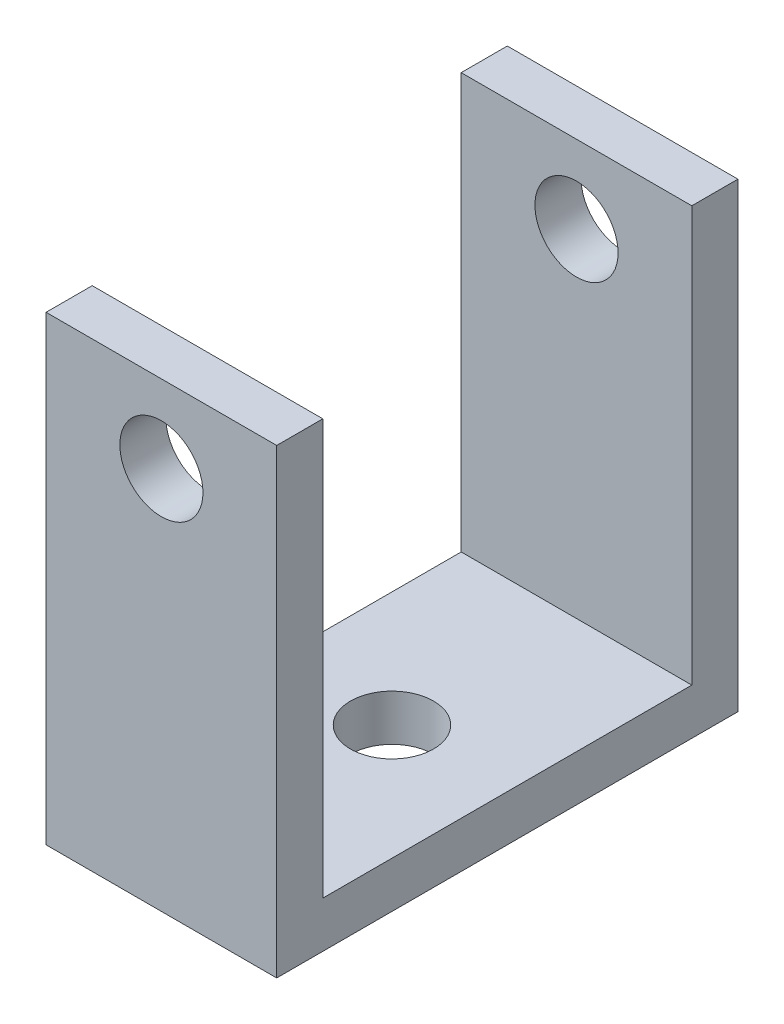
ISO-10303-21;
HEADER;
FILE_DESCRIPTION(('STEP AP214'),'2;1');
FILE_NAME('part.step','',(''),(''),'','','');
FILE_SCHEMA(('AUTOMOTIVE_DESIGN { 1 0 10303 214 1 1 1 1 }'));
ENDSEC;
DATA;
#1=APPLICATION_CONTEXT('core data for automotive mechanical design processes');
#2=APPLICATION_PROTOCOL_DEFINITION('international standard','automotive_design',2000,#1);
#3=PRODUCT_CONTEXT('',#1,'mechanical');
#4=PRODUCT('Part','Part','',(#3));
#5=PRODUCT_RELATED_PRODUCT_CATEGORY('part','',(#4));
#6=PRODUCT_DEFINITION_FORMATION('','',#4);
#7=PRODUCT_DEFINITION_CONTEXT('part definition',#1,'design');
#8=PRODUCT_DEFINITION('design','',#6,#7);
#9=PRODUCT_DEFINITION_SHAPE('','',#8);
#10=(LENGTH_UNIT() NAMED_UNIT(*) SI_UNIT(.MILLI.,.METRE.));
#11=(NAMED_UNIT(*) PLANE_ANGLE_UNIT() SI_UNIT($,.RADIAN.));
#12=(NAMED_UNIT(*) SI_UNIT($,.STERADIAN.) SOLID_ANGLE_UNIT());
#13=UNCERTAINTY_MEASURE_WITH_UNIT(LENGTH_MEASURE(1.E-05),#10,'distance_accuracy_value','');
#14=(GEOMETRIC_REPRESENTATION_CONTEXT(3) GLOBAL_UNCERTAINTY_ASSIGNED_CONTEXT((#13)) GLOBAL_UNIT_ASSIGNED_CONTEXT((#10,
#11,#12)) REPRESENTATION_CONTEXT('',''));
#15=CARTESIAN_POINT('',(0.,0.,0.));
#16=DIRECTION('',(0.,0.,1.));
#17=DIRECTION('',(1.,0.,0.));
#18=AXIS2_PLACEMENT_3D('',#15,#16,#17);
#19=CARTESIAN_POINT('',(6.35,25.4,10.16));
#20=DIRECTION('',(0.,0.,1.));
#21=DIRECTION('',(0.,-1.,0.));
#22=AXIS2_PLACEMENT_3D('',#19,#20,#21);
#23=PLANE('',#22);
#24=CARTESIAN_POINT('',(0.,21.114069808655,10.16));
#25=DIRECTION('',(0.,0.,1.));
#26=DIRECTION('',(0.,-1.,0.));
#27=AXIS2_PLACEMENT_3D('',#24,#25,#26);
#28=CIRCLE('',#27,2.28918060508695);
#29=CARTESIAN_POINT('',(0.,18.824889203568,10.16));
#30=VERTEX_POINT('',#29);
#31=EDGE_CURVE('E135',#30,#30,#28,.T.);
#32=ORIENTED_EDGE('',*,*,#31,.T.);
#33=EDGE_LOOP('',(#32));
#34=FACE_BOUND('',#33,.T.);
#35=DIRECTION('',(0.,1.,0.));
#36=VECTOR('',#35,1.);
#37=CARTESIAN_POINT('',(-6.35,25.4,10.16));
#38=LINE('',#37,#36);
#39=CARTESIAN_POINT('',(-6.35,2.54,10.16));
#40=VERTEX_POINT('',#39);
#41=CARTESIAN_POINT('',(-6.35,25.4,10.16));
#42=VERTEX_POINT('',#41);
#43=EDGE_CURVE('E131',#40,#42,#38,.T.);
#44=ORIENTED_EDGE('',*,*,#43,.T.);
#45=DIRECTION('',(-1.,0.,0.));
#46=VECTOR('',#45,1.);
#47=CARTESIAN_POINT('',(6.35,25.4,10.16));
#48=LINE('',#47,#46);
#49=CARTESIAN_POINT('',(6.35,25.4,10.16));
#50=VERTEX_POINT('',#49);
#51=EDGE_CURVE('E11',#50,#42,#48,.T.);
#52=ORIENTED_EDGE('',*,*,#51,.F.);
#53=DIRECTION('',(0.,1.,0.));
#54=VECTOR('',#53,1.);
#55=CARTESIAN_POINT('',(6.35,25.4,10.16));
#56=LINE('',#55,#54);
#57=CARTESIAN_POINT('',(6.35,2.54,10.16));
#58=VERTEX_POINT('',#57);
#59=EDGE_CURVE('E89',#58,#50,#56,.T.);
#60=ORIENTED_EDGE('',*,*,#59,.F.);
#61=DIRECTION('',(-1.,0.,0.));
#62=VECTOR('',#61,1.);
#63=CARTESIAN_POINT('',(6.35,2.54,10.16));
#64=LINE('',#63,#62);
#65=EDGE_CURVE('E130',#58,#40,#64,.T.);
#66=ORIENTED_EDGE('',*,*,#65,.T.);
#67=EDGE_LOOP('',(#44,#52,#60,#66));
#68=FACE_BOUND('',#67,.T.);
#69=ADVANCED_FACE('F32',(#34,#68),#23,.F.);
#70=CARTESIAN_POINT('',(6.35,25.4,12.7));
#71=DIRECTION('',(0.,1.,0.));
#72=DIRECTION('',(0.,0.,1.));
#73=AXIS2_PLACEMENT_3D('',#70,#71,#72);
#74=PLANE('',#73);
#75=DIRECTION('',(0.,0.,-1.));
#76=VECTOR('',#75,1.);
#77=CARTESIAN_POINT('',(-6.35,25.4,12.7));
#78=LINE('',#77,#76);
#79=CARTESIAN_POINT('',(-6.35,25.4,12.7));
#80=VERTEX_POINT('',#79);
#81=EDGE_CURVE('E134',#80,#42,#78,.T.);
#82=ORIENTED_EDGE('',*,*,#81,.F.);
#83=DIRECTION('',(-1.,0.,0.));
#84=VECTOR('',#83,1.);
#85=CARTESIAN_POINT('',(6.35,25.4,12.7));
#86=LINE('',#85,#84);
#87=CARTESIAN_POINT('',(6.35,25.4,12.7));
#88=VERTEX_POINT('',#87);
#89=EDGE_CURVE('E41',#88,#80,#86,.T.);
#90=ORIENTED_EDGE('',*,*,#89,.F.);
#91=DIRECTION('',(0.,0.,-1.));
#92=VECTOR('',#91,1.);
#93=CARTESIAN_POINT('',(6.35,25.4,12.7));
#94=LINE('',#93,#92);
#95=EDGE_CURVE('E174',#88,#50,#94,.T.);
#96=ORIENTED_EDGE('',*,*,#95,.T.);
#97=ORIENTED_EDGE('',*,*,#51,.T.);
#98=EDGE_LOOP('',(#82,#90,#96,#97));
#99=FACE_BOUND('',#98,.T.);
#100=ADVANCED_FACE('F206',(#99),#74,.T.);
#101=CARTESIAN_POINT('',(6.35,25.4,12.7));
#102=DIRECTION('',(0.,0.,1.));
#103=DIRECTION('',(0.,-1.,0.));
#104=AXIS2_PLACEMENT_3D('',#101,#102,#103);
#105=PLANE('',#104);
#106=CARTESIAN_POINT('',(0.,21.114069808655,12.7));
#107=DIRECTION('',(0.,0.,1.));
#108=DIRECTION('',(1.,0.,0.));
#109=AXIS2_PLACEMENT_3D('',#106,#107,#108);
#110=CIRCLE('',#109,2.28918060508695);
#111=CARTESIAN_POINT('',(2.28918060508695,21.114069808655,12.7));
#112=VERTEX_POINT('',#111);
#113=EDGE_CURVE('E165',#112,#112,#110,.T.);
#114=ORIENTED_EDGE('',*,*,#113,.F.);
#115=EDGE_LOOP('',(#114));
#116=FACE_BOUND('',#115,.T.);
#117=DIRECTION('',(0.,1.,0.));
#118=VECTOR('',#117,1.);
#119=CARTESIAN_POINT('',(-6.35,25.4,12.7));
#120=LINE('',#119,#118);
#121=CARTESIAN_POINT('',(-6.35,0.,12.7));
#122=VERTEX_POINT('',#121);
#123=EDGE_CURVE('E138',#122,#80,#120,.T.);
#124=ORIENTED_EDGE('',*,*,#123,.F.);
#125=DIRECTION('',(-1.,0.,0.));
#126=VECTOR('',#125,1.);
#127=CARTESIAN_POINT('',(6.35,0.,12.7));
#128=LINE('',#127,#126);
#129=CARTESIAN_POINT('',(6.35,0.,12.7));
#130=VERTEX_POINT('',#129);
#131=EDGE_CURVE('E155',#130,#122,#128,.T.);
#132=ORIENTED_EDGE('',*,*,#131,.F.);
#133=DIRECTION('',(0.,1.,0.));
#134=VECTOR('',#133,1.);
#135=CARTESIAN_POINT('',(6.35,25.4,12.7));
#136=LINE('',#135,#134);
#137=EDGE_CURVE('E177',#130,#88,#136,.T.);
#138=ORIENTED_EDGE('',*,*,#137,.T.);
#139=ORIENTED_EDGE('',*,*,#89,.T.);
#140=EDGE_LOOP('',(#124,#132,#138,#139));
#141=FACE_BOUND('',#140,.T.);
#142=ADVANCED_FACE('F211',(#116,#141),#105,.T.);
#143=CARTESIAN_POINT('',(6.35,0.,12.7));
#144=DIRECTION('',(0.,-1.,0.));
#145=DIRECTION('',(0.,0.,-1.));
#146=AXIS2_PLACEMENT_3D('',#143,#144,#145);
#147=PLANE('',#146);
#148=CARTESIAN_POINT('',(0.,0.,0.));
#149=DIRECTION('',(0.,-1.,0.));
#150=DIRECTION('',(0.,0.,-1.));
#151=AXIS2_PLACEMENT_3D('',#148,#149,#150);
#152=CIRCLE('',#151,2.28918060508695);
#153=CARTESIAN_POINT('',(0.,0.,-2.28918060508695));
#154=VERTEX_POINT('',#153);
#155=EDGE_CURVE('E315',#154,#154,#152,.T.);
#156=ORIENTED_EDGE('',*,*,#155,.F.);
#157=EDGE_LOOP('',(#156));
#158=FACE_BOUND('',#157,.T.);
#159=DIRECTION('',(0.,0.,1.));
#160=VECTOR('',#159,1.);
#161=CARTESIAN_POINT('',(-6.35,0.,12.7));
#162=LINE('',#161,#160);
#163=CARTESIAN_POINT('',(-6.35,0.,-12.7));
#164=VERTEX_POINT('',#163);
#165=EDGE_CURVE('E141',#164,#122,#162,.T.);
#166=ORIENTED_EDGE('',*,*,#165,.F.);
#167=DIRECTION('',(-1.,0.,0.));
#168=VECTOR('',#167,1.);
#169=CARTESIAN_POINT('',(6.35,0.,-12.7));
#170=LINE('',#169,#168);
#171=CARTESIAN_POINT('',(6.35,0.,-12.7));
#172=VERTEX_POINT('',#171);
#173=EDGE_CURVE('E153',#172,#164,#170,.T.);
#174=ORIENTED_EDGE('',*,*,#173,.F.);
#175=DIRECTION('',(0.,0.,1.));
#176=VECTOR('',#175,1.);
#177=CARTESIAN_POINT('',(6.35,0.,12.7));
#178=LINE('',#177,#176);
#179=EDGE_CURVE('E125',#172,#130,#178,.T.);
#180=ORIENTED_EDGE('',*,*,#179,.T.);
#181=ORIENTED_EDGE('',*,*,#131,.T.);
#182=EDGE_LOOP('',(#166,#174,#180,#181));
#183=FACE_BOUND('',#182,.T.);
#184=ADVANCED_FACE('F182',(#158,#183),#147,.T.);
#185=CARTESIAN_POINT('',(6.35,25.4,-12.7));
#186=DIRECTION('',(0.,0.,-1.));
#187=DIRECTION('',(0.,1.,0.));
#188=AXIS2_PLACEMENT_3D('',#185,#186,#187);
#189=PLANE('',#188);
#190=CARTESIAN_POINT('',(0.,21.114069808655,-12.7));
#191=DIRECTION('',(0.,0.,1.));
#192=DIRECTION('',(1.,0.,0.));
#193=AXIS2_PLACEMENT_3D('',#190,#191,#192);
#194=CIRCLE('',#193,2.28918060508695);
#195=CARTESIAN_POINT('',(2.28918060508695,21.114069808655,-12.7));
#196=VERTEX_POINT('',#195);
#197=EDGE_CURVE('E159',#196,#196,#194,.T.);
#198=ORIENTED_EDGE('',*,*,#197,.T.);
#199=EDGE_LOOP('',(#198));
#200=FACE_BOUND('',#199,.T.);
#201=DIRECTION('',(0.,-1.,0.));
#202=VECTOR('',#201,1.);
#203=CARTESIAN_POINT('',(-6.35,25.4,-12.7));
#204=LINE('',#203,#202);
#205=CARTESIAN_POINT('',(-6.35,25.4,-12.7));
#206=VERTEX_POINT('',#205);
#207=EDGE_CURVE('E144',#206,#164,#204,.T.);
#208=ORIENTED_EDGE('',*,*,#207,.F.);
#209=DIRECTION('',(-1.,0.,0.));
#210=VECTOR('',#209,1.);
#211=CARTESIAN_POINT('',(6.35,25.4,-12.7));
#212=LINE('',#211,#210);
#213=CARTESIAN_POINT('',(6.35,25.4,-12.7));
#214=VERTEX_POINT('',#213);
#215=EDGE_CURVE('E113',#214,#206,#212,.T.);
#216=ORIENTED_EDGE('',*,*,#215,.F.);
#217=DIRECTION('',(0.,-1.,0.));
#218=VECTOR('',#217,1.);
#219=CARTESIAN_POINT('',(6.35,25.4,-12.7));
#220=LINE('',#219,#218);
#221=EDGE_CURVE('E123',#214,#172,#220,.T.);
#222=ORIENTED_EDGE('',*,*,#221,.T.);
#223=ORIENTED_EDGE('',*,*,#173,.T.);
#224=EDGE_LOOP('',(#208,#216,#222,#223));
#225=FACE_BOUND('',#224,.T.);
#226=ADVANCED_FACE('F187',(#200,#225),#189,.T.);
#227=CARTESIAN_POINT('',(6.35,25.4,-10.16));
#228=DIRECTION('',(0.,1.,0.));
#229=DIRECTION('',(0.,0.,1.));
#230=AXIS2_PLACEMENT_3D('',#227,#228,#229);
#231=PLANE('',#230);
#232=DIRECTION('',(0.,0.,-1.));
#233=VECTOR('',#232,1.);
#234=CARTESIAN_POINT('',(-6.35,25.4,-10.16));
#235=LINE('',#234,#233);
#236=CARTESIAN_POINT('',(-6.35,25.4,-10.16));
#237=VERTEX_POINT('',#236);
#238=EDGE_CURVE('E112',#237,#206,#235,.T.);
#239=ORIENTED_EDGE('',*,*,#238,.F.);
#240=DIRECTION('',(-1.,0.,0.));
#241=VECTOR('',#240,1.);
#242=CARTESIAN_POINT('',(6.35,25.4,-10.16));
#243=LINE('',#242,#241);
#244=CARTESIAN_POINT('',(6.35,25.4,-10.16));
#245=VERTEX_POINT('',#244);
#246=EDGE_CURVE('E106',#245,#237,#243,.T.);
#247=ORIENTED_EDGE('',*,*,#246,.F.);
#248=DIRECTION('',(0.,0.,-1.));
#249=VECTOR('',#248,1.);
#250=CARTESIAN_POINT('',(6.35,25.4,-10.16));
#251=LINE('',#250,#249);
#252=EDGE_CURVE('E110',#245,#214,#251,.T.);
#253=ORIENTED_EDGE('',*,*,#252,.T.);
#254=ORIENTED_EDGE('',*,*,#215,.T.);
#255=EDGE_LOOP('',(#239,#247,#253,#254));
#256=FACE_BOUND('',#255,.T.);
#257=ADVANCED_FACE('F108',(#256),#231,.T.);
#258=CARTESIAN_POINT('',(6.35,25.4,-10.16));
#259=DIRECTION('',(0.,0.,-1.));
#260=DIRECTION('',(0.,1.,0.));
#261=AXIS2_PLACEMENT_3D('',#258,#259,#260);
#262=PLANE('',#261);
#263=CARTESIAN_POINT('',(0.,21.114069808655,-10.16));
#264=DIRECTION('',(0.,0.,-1.));
#265=DIRECTION('',(0.,1.,0.));
#266=AXIS2_PLACEMENT_3D('',#263,#264,#265);
#267=CIRCLE('',#266,2.28918060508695);
#268=CARTESIAN_POINT('',(0.,23.4032504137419,-10.16));
#269=VERTEX_POINT('',#268);
#270=EDGE_CURVE('E157',#269,#269,#267,.T.);
#271=ORIENTED_EDGE('',*,*,#270,.T.);
#272=EDGE_LOOP('',(#271));
#273=FACE_BOUND('',#272,.T.);
#274=DIRECTION('',(0.,-1.,0.));
#275=VECTOR('',#274,1.);
#276=CARTESIAN_POINT('',(-6.35,25.4,-10.16));
#277=LINE('',#276,#275);
#278=CARTESIAN_POINT('',(-6.35,2.54,-10.16));
#279=VERTEX_POINT('',#278);
#280=EDGE_CURVE('E77',#237,#279,#277,.T.);
#281=ORIENTED_EDGE('',*,*,#280,.T.);
#282=DIRECTION('',(-1.,0.,0.));
#283=VECTOR('',#282,1.);
#284=CARTESIAN_POINT('',(6.35,2.54,-10.16));
#285=LINE('',#284,#283);
#286=CARTESIAN_POINT('',(6.35,2.54,-10.16));
#287=VERTEX_POINT('',#286);
#288=EDGE_CURVE('E114',#287,#279,#285,.T.);
#289=ORIENTED_EDGE('',*,*,#288,.F.);
#290=DIRECTION('',(0.,-1.,0.));
#291=VECTOR('',#290,1.);
#292=CARTESIAN_POINT('',(6.35,25.4,-10.16));
#293=LINE('',#292,#291);
#294=EDGE_CURVE('E116',#245,#287,#293,.T.);
#295=ORIENTED_EDGE('',*,*,#294,.F.);
#296=ORIENTED_EDGE('',*,*,#246,.T.);
#297=EDGE_LOOP('',(#281,#289,#295,#296));
#298=FACE_BOUND('',#297,.T.);
#299=ADVANCED_FACE('F117',(#273,#298),#262,.F.);
#300=CARTESIAN_POINT('',(6.35,2.54,12.7));
#301=DIRECTION('',(0.,-1.,0.));
#302=DIRECTION('',(0.,0.,-1.));
#303=AXIS2_PLACEMENT_3D('',#300,#301,#302);
#304=PLANE('',#303);
#305=CARTESIAN_POINT('',(0.,2.54,0.));
#306=DIRECTION('',(0.,-1.,0.));
#307=DIRECTION('',(0.,0.,-1.));
#308=AXIS2_PLACEMENT_3D('',#305,#306,#307);
#309=CIRCLE('',#308,2.28918060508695);
#310=CARTESIAN_POINT('',(0.,2.54,-2.28918060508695));
#311=VERTEX_POINT('',#310);
#312=EDGE_CURVE('E35',#311,#311,#309,.T.);
#313=ORIENTED_EDGE('',*,*,#312,.T.);
#314=EDGE_LOOP('',(#313));
#315=FACE_BOUND('',#314,.T.);
#316=DIRECTION('',(0.,0.,-1.));
#317=VECTOR('',#316,1.);
#318=CARTESIAN_POINT('',(-6.35,2.54,12.7));
#319=LINE('',#318,#317);
#320=EDGE_CURVE('E83',#279,#40,#319,.F.);
#321=ORIENTED_EDGE('',*,*,#320,.T.);
#322=ORIENTED_EDGE('',*,*,#65,.F.);
#323=DIRECTION('',(0.,0.,-1.));
#324=VECTOR('',#323,1.);
#325=CARTESIAN_POINT('',(6.35,2.54,12.7));
#326=LINE('',#325,#324);
#327=EDGE_CURVE('E50',#287,#58,#326,.F.);
#328=ORIENTED_EDGE('',*,*,#327,.F.);
#329=ORIENTED_EDGE('',*,*,#288,.T.);
#330=EDGE_LOOP('',(#321,#322,#328,#329));
#331=FACE_BOUND('',#330,.T.);
#332=ADVANCED_FACE('F193',(#315,#331),#304,.F.);
#333=CARTESIAN_POINT('',(6.35,25.4,10.16));
#334=DIRECTION('',(-1.,0.,0.));
#335=DIRECTION('',(0.,0.,1.));
#336=AXIS2_PLACEMENT_3D('',#333,#334,#335);
#337=PLANE('',#336);
#338=ORIENTED_EDGE('',*,*,#59,.T.);
#339=ORIENTED_EDGE('',*,*,#95,.F.);
#340=ORIENTED_EDGE('',*,*,#137,.F.);
#341=ORIENTED_EDGE('',*,*,#179,.F.);
#342=ORIENTED_EDGE('',*,*,#221,.F.);
#343=ORIENTED_EDGE('',*,*,#252,.F.);
#344=ORIENTED_EDGE('',*,*,#294,.T.);
#345=ORIENTED_EDGE('',*,*,#327,.T.);
#346=EDGE_LOOP('',(#338,#339,#340,#341,#342,#343,#344,#345));
#347=FACE_BOUND('',#346,.T.);
#348=ADVANCED_FACE('F120',(#347),#337,.F.);
#349=CARTESIAN_POINT('',(-6.35,25.4,10.16));
#350=DIRECTION('',(-1.,0.,0.));
#351=DIRECTION('',(0.,0.,1.));
#352=AXIS2_PLACEMENT_3D('',#349,#350,#351);
#353=PLANE('',#352);
#354=ORIENTED_EDGE('',*,*,#43,.F.);
#355=ORIENTED_EDGE('',*,*,#320,.F.);
#356=ORIENTED_EDGE('',*,*,#280,.F.);
#357=ORIENTED_EDGE('',*,*,#238,.T.);
#358=ORIENTED_EDGE('',*,*,#207,.T.);
#359=ORIENTED_EDGE('',*,*,#165,.T.);
#360=ORIENTED_EDGE('',*,*,#123,.T.);
#361=ORIENTED_EDGE('',*,*,#81,.T.);
#362=EDGE_LOOP('',(#354,#355,#356,#357,#358,#359,#360,#361));
#363=FACE_BOUND('',#362,.T.);
#364=ADVANCED_FACE('F190',(#363),#353,.T.);
#365=CARTESIAN_POINT('',(0.,21.114069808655,-12.7));
#366=DIRECTION('',(0.,0.,1.));
#367=DIRECTION('',(1.,0.,0.));
#368=AXIS2_PLACEMENT_3D('',#365,#366,#367);
#369=CYLINDRICAL_SURFACE('',#368,2.28918060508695);
#370=ORIENTED_EDGE('',*,*,#197,.F.);
#371=EDGE_LOOP('',(#370));
#372=FACE_BOUND('',#371,.T.);
#373=ORIENTED_EDGE('',*,*,#270,.F.);
#374=EDGE_LOOP('',(#373));
#375=FACE_BOUND('',#374,.T.);
#376=ADVANCED_FACE('F218',(#372,#375),#369,.F.);
#377=ORIENTED_EDGE('',*,*,#113,.T.);
#378=EDGE_LOOP('',(#377));
#379=FACE_BOUND('',#378,.T.);
#380=ORIENTED_EDGE('',*,*,#31,.F.);
#381=EDGE_LOOP('',(#380));
#382=FACE_BOUND('',#381,.T.);
#383=ADVANCED_FACE('F215',(#379,#382),#369,.F.);
#384=CARTESIAN_POINT('',(0.,25.4,0.));
#385=DIRECTION('',(0.,-1.,0.));
#386=DIRECTION('',(0.,0.,-1.));
#387=AXIS2_PLACEMENT_3D('',#384,#385,#386);
#388=CYLINDRICAL_SURFACE('',#387,2.28918060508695);
#389=ORIENTED_EDGE('',*,*,#155,.T.);
#390=EDGE_LOOP('',(#389));
#391=FACE_BOUND('',#390,.T.);
#392=ORIENTED_EDGE('',*,*,#312,.F.);
#393=EDGE_LOOP('',(#392));
#394=FACE_BOUND('',#393,.T.);
#395=ADVANCED_FACE('F217',(#391,#394),#388,.F.);
#396=CLOSED_SHELL('',(#69,#100,#142,#184,#226,#257,#299,#332,#348,#364,#376,#383,#395));
#397=MANIFOLD_SOLID_BREP('B2',#396);
#398=ADVANCED_BREP_SHAPE_REPRESENTATION('',(#18,#397),#14);
#399=SHAPE_DEFINITION_REPRESENTATION(#9,#398);
ENDSEC;
END-ISO-10303-21;
